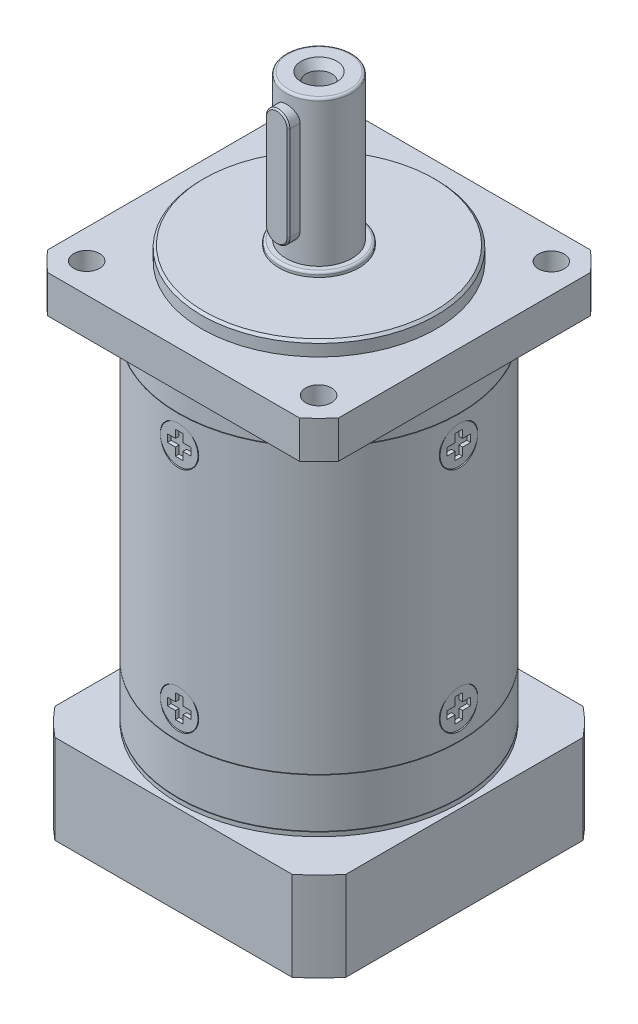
from build123d import *

# Parameters (mm, degrees)
SKETCH_1_R                = 25
EXTRUDE_1_DEPTH           = 3
SKETCH_2_R                = 30
EXTRUDE_2_DEPTH           = 13
SKETCH_3_R                = 30
EXTRUDE_3_DEPTH           = 60.4
SKETCH_4_R                = 30
EXTRUDE_4_DEPTH           = 10.4
SKETCH_5_R                = 30
EXTRUDE_5_DEPTH           = 0.9
EXTRUDE_6_DEPTH           = 19
SKETCH_7_R                = 25
CUT_EXTRUDE_1_DEPTH       = 5
SKETCH_8_R                = 17.5
CUT_EXTRUDE_2_DEPTH       = 19
SKETCH_9_R                = 16
EXTRUDE_7_DEPTH           = 17
CHAMFER_1_SIZE            = 1
SKETCH_10_R               = 7
CUT_EXTRUDE_3_DEPTH       = 32
SKETCH_11_W               = 33.69437378
SKETCH_11_H               = 1
CUT_EXTRUDE_4_DEPTH       = 17
SKETCH_12_R               = 4
CUT_EXTRUDE_5_DEPTH       = 12
PATTERN_CIRCULAR_1_COUNT  = 4
CHAMFER_3_SIZE            = 0.5
PATTERN_CIRCULAR_2_COUNT  = 4
SKETCH_15_R               = 8.5
EXTRUDE_8_DEPTH           = 1
SKETCH_16_R               = 7
EXTRUDE_9_DEPTH           = 31
FILLET_1_R                = 0.5
FILLET_2_R                = 0.5
SKETCH_19_R               = 4.1
CUT_EXTRUDE_6_DEPTH       = 31
PATTERN_CIRCULAR_5_COUNT  = 4
SKETCH_20_R               = 4
EXTRUDE_10_DEPTH          = 0.8
PATTERN_CIRCULAR_21_COUNT = 4
SKETCH_21_R               = 3.5
EXTRUDE_11_DEPTH          = 4
PATTERN_CIRCULAR_22_COUNT = 4
EXTRUDE_12_DEPTH          = 9
CHAMFER_4_SIZE            = 0.3
SKETCH_23_R               = 29.5
EXTRUDE_13_DEPTH          = 8
SKETCH_24_R               = 2.75
CUT_EXTRUDE_7_DEPTH       = 8
PATTERN_CIRCULAR_23_COUNT = 4
SKETCH_25_R               = 2.75
CUT_EXTRUDE_8_DEPTH       = 4.8
SKETCH_26_R               = 2.75
SKETCH_27_R               = 3.8


with BuildPart() as part:
    # Sketch 1 → Extrude 1 (new body)
    with BuildSketch(Plane(origin=(0, 0, 0), x_dir=(1, 0, 0), z_dir=(0, 1, 0))):
        with Locations(Location((0, 0, 0), (0, 0, 270))):
            Circle(SKETCH_1_R)
    extrude(amount=EXTRUDE_1_DEPTH)

    # Sketch 2 → Extrude 2 (add)
    with BuildSketch(Plane.XZ):
        with Locations(Location((0, 0, 0), (0, 0, 90))):
            Circle(SKETCH_2_R)
    extrude(amount=EXTRUDE_2_DEPTH)

    # Chamfer 3
    chamfer_3_edges = [part.edges().sort_by_distance(p)[0] for p in [
        (0, 3, -25),
    ]]
    chamfer(chamfer_3_edges, length=CHAMFER_3_SIZE)

    # Sketch 15 → Extrude 8 (add)
    with BuildSketch(Plane(origin=(0, 3, 0), x_dir=(1, 0, 0), z_dir=(0, 1, 0))):
        with Locations(Location((0, 0, 0), (0, 0, 270))):
            Circle(SKETCH_15_R)
    extrude(amount=EXTRUDE_8_DEPTH)

    # Sketch 16 → Extrude 9 (add)
    with BuildSketch(Plane(origin=(0, 4, 0), x_dir=(1, 0, 0), z_dir=(0, 1, 0))):
        with Locations(Location((0, 0, 0), (0, 0, 90))):
            Circle(SKETCH_16_R)
    extrude(amount=EXTRUDE_9_DEPTH)

    # Fillet 1
    fillet_1_edges = [part.edges().sort_by_distance(p)[0] for p in [
        (0, 4, -8.5),
    ]]
    fillet(fillet_1_edges, radius=FILLET_1_R)

    # Fillet 2
    fillet_2_edges = [part.edges().sort_by_distance(p)[0] for p in [
        (0, 35, 7),
    ]]
    fillet(fillet_2_edges, radius=FILLET_2_R)

    # Sketch 22 → Extrude 12 (add)
    with BuildSketch(Plane.XY):
        with BuildLine():
            Line((-2.5, 30), (-2.5, 10))
            ThreePointArc((-2.5, 10), (0, 7.5), (2.5, 10))
            Line((2.5, 10), (2.5, 30))
            ThreePointArc((2.5, 30), (0, 32.5), (-2.5, 30))
        make_face()
    extrude(amount=EXTRUDE_12_DEPTH)

    # Chamfer 4
    chamfer_4_edges = [part.edges().sort_by_distance(p)[0] for p in [
        (0, 32.5, 9),
        (-2.5, 20, 9),
        (0, 7.5, 9),
        (2.5, 20, 9),
    ]]
    chamfer(chamfer_4_edges, length=CHAMFER_4_SIZE)


with BuildPart() as body_2:
    # Sketch 3 → Extrude 3 (new body)
    with BuildSketch(Plane.XZ.offset(13.1)):
        with Locations(Location((0, 0, 0), (0, 0, 270))):
            Circle(SKETCH_3_R)
    extrude(amount=EXTRUDE_3_DEPTH)


with BuildPart() as body_3:
    # Sketch 4 → Extrude 4 (new body)
    with BuildSketch(Plane.XZ.offset(73.6)):
        with Locations(Location((0, 0, 0), (0, 0, 270))):
            Circle(SKETCH_4_R)
    extrude(amount=EXTRUDE_4_DEPTH)


with BuildPart() as body_4:
    # Sketch 5 → Extrude 5 (new body)
    with BuildSketch(Plane.XZ.offset(84.1)):
        with Locations(Location((0, 0, 0), (0, 0, 270))):
            Circle(SKETCH_5_R)
    extrude(amount=EXTRUDE_5_DEPTH)

    # Sketch 6 → Extrude 6 (add)
    with BuildSketch(Plane.XZ.offset(85)):
        with BuildLine():
            Line((-25.27844932, 31), (25.27844932, 31))
            ThreePointArc((25.27844932, 31), (28.284271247, 28.284271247), (31, 25.27844932))
            Line((31, 25.27844932), (31, -25.27844932))
            ThreePointArc((31, -25.27844932), (28.284271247, -28.284271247), (25.27844932, -31))
            Line((25.27844932, -31), (-25.27844932, -31))
            ThreePointArc((-25.27844932, -31), (-28.284271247, -28.284271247), (-31, -25.27844932))
            Line((-31, -25.27844932), (-31, 25.27844932))
            ThreePointArc((-31, 25.27844932), (-28.284271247, 28.284271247), (-25.27844932, 31))
        make_face()
    extrude(amount=EXTRUDE_6_DEPTH)

    # Sketch 7 → Cut-Extrude 1 (cut)
    with BuildSketch(Plane.XZ.offset(104)):
        with Locations(Location((0, 0, 0), (0, 0, 270))):
            Circle(SKETCH_7_R)
    extrude(amount=-CUT_EXTRUDE_1_DEPTH, mode=Mode.SUBTRACT)


with BuildPart() as cut_extrude_2_tool:
    # Sketch 8 → Cut-Extrude 2 (new body)
    with BuildSketch(Plane.XZ.offset(99)):
        with Locations(Location((0, 0, 0), (0, 0, 270))):
            Circle(SKETCH_8_R)
    extrude(amount=-CUT_EXTRUDE_2_DEPTH)


with BuildPart() as body_3_1:
    add(body_3.part)

    # Cut-Extrude 2: cut by cut_extrude_2_tool
    add(cut_extrude_2_tool.part, mode=Mode.SUBTRACT)

    # Sketch 9 → Extrude 7 (add)
    with BuildSketch(Plane.XZ.offset(97)):
        with Locations(Location((0, 0, 0), (0, 0, 270))):
            Circle(SKETCH_9_R)
    extrude(amount=-EXTRUDE_7_DEPTH)

    # Chamfer 1
    chamfer_1_edges = [body_3_1.edges().sort_by_distance(p)[0] for p in [
        (0, -97, 16),
    ]]
    chamfer(chamfer_1_edges, length=CHAMFER_1_SIZE)


with BuildPart() as body_4_1:
    add(body_4.part)

    # Cut-Extrude 2: cut by cut_extrude_2_tool
    add(cut_extrude_2_tool.part, mode=Mode.SUBTRACT)

    # Sketch 12 → Cut-Extrude 5 (cut)
    with BuildSketch(Plane.XZ.offset(104)):
        with Locations(Location((-12.75, 22.083647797, 0), (0, 0, 270))):
            Circle(SKETCH_12_R)
    cut_extrude_5 = extrude(amount=-CUT_EXTRUDE_5_DEPTH, mode=Mode.SUBTRACT)

    # Pattern Circular 1: Cut-Extrude 5 ×4 about axis
    pattern_circular_1_axis = Axis((0, 0, 0), (0, 1, 0))
    for i in range(1, PATTERN_CIRCULAR_1_COUNT):
        add(cut_extrude_5.rotate(pattern_circular_1_axis, i * 360 / PATTERN_CIRCULAR_1_COUNT), mode=Mode.SUBTRACT)

    # Sketch 14 → Hole Wizard M4 _1 (revolve, cut)
    with BuildSketch(Plane(origin=(-24.748737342, -104, -24.748737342), x_dir=(0, 0, -1), z_dir=(1, 0, 0))):
        Polygon((0, 0), (0, 14.491420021), (1.65, 13.5), (1.65, 0), align=None)
    hole_wizard_m4_1 = revolve(axis=Axis((-24.748737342, -110.35, -24.748737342), (0, 1, 0)), mode=Mode.SUBTRACT)

    # Pattern Circular 2: Hole Wizard M4 _1 ×4 about axis
    pattern_circular_2_axis = Axis((0, 0, 0), (0, 1, 0))
    for i in range(1, PATTERN_CIRCULAR_2_COUNT):
        add(hole_wizard_m4_1.rotate(pattern_circular_2_axis, i * 360 / PATTERN_CIRCULAR_2_COUNT), mode=Mode.SUBTRACT)

    # Sketch 21 → Extrude 11 (add)
    with BuildSketch(Plane.XZ.offset(92)):
        with Locations(Location((-12.75, 22.083647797, 0), (0, 0, 270))):
            Circle(SKETCH_21_R)
        Polygon((-11.866340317, 23.573327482), (-13.598270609, 23.593759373), (-14.481930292, 22.104079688), (-13.633659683, 20.593968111), (-11.901729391, 20.57353622), (-11.018069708, 22.063215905), align=None, mode=Mode.SUBTRACT)
    extrude_11 = extrude(amount=EXTRUDE_11_DEPTH)

    # Pattern Circular 22: Extrude 11 ×4 about axis
    pattern_circular_22_axis = Axis((0, 0, 0), (0, 1, 0))
    for i in range(1, PATTERN_CIRCULAR_22_COUNT):
        add(extrude_11.rotate(pattern_circular_22_axis, i * 360 / PATTERN_CIRCULAR_22_COUNT))


with BuildPart() as cut_extrude_3_tool:
    # Sketch 10 → Cut-Extrude 3 (new body)
    with BuildSketch(Plane.XZ.offset(104)):
        with Locations(Location((0, 0, 0), (0, 0, 270))):
            Circle(SKETCH_10_R)
    extrude(amount=-CUT_EXTRUDE_3_DEPTH)


with BuildPart() as body_2_1:
    add(body_2.part)

    # Cut-Extrude 3: cut by cut_extrude_3_tool
    add(cut_extrude_3_tool.part, mode=Mode.SUBTRACT)

    # Sketch 19 → Cut-Extrude 6 (cut)
    with BuildSketch(Plane.XY.offset(29)):
        with Locations(Location((0, -19, 0), (0, 0, 270))):
            Circle(SKETCH_19_R)
        with Locations(Location((0, -67.6, 0), (0, 0, 270))):
            Circle(SKETCH_19_R)
    cut_extrude_6 = extrude(amount=CUT_EXTRUDE_6_DEPTH, mode=Mode.SUBTRACT)

    # Pattern Circular 5: Cut-Extrude 6 ×4 about axis
    pattern_circular_5_axis = Axis((0, 0, 0), (0, 1, 0))
    for i in range(1, PATTERN_CIRCULAR_5_COUNT):
        add(cut_extrude_6.rotate(pattern_circular_5_axis, i * 360 / PATTERN_CIRCULAR_5_COUNT), mode=Mode.SUBTRACT)

    # Sketch 20 → Extrude 10 (add)
    # profile 1 of 2: a face of its own
    with BuildSketch(Plane.XY.offset(29)):
        with Locations((0, -19)):
            Circle(SKETCH_20_R)
        Polygon((0.8, -19.8), (0.8, -21.5), (-0.8, -21.5), (-0.8, -19.8), (-2.5, -19.8), (-2.5, -18.2), (-0.8, -18.2), (-0.8, -16.5), (0.8, -16.5), (0.8, -18.2), (2.5, -18.2), (2.5, -19.8), align=None, mode=Mode.SUBTRACT)
    # profile 2 of 2: a face of its own
    with BuildSketch(Plane.XY.offset(29)):
        with Locations((0, -67.6)):
            Circle(SKETCH_20_R)
        Polygon((0.8, -68.4), (0.8, -70.1), (-0.8, -70.1), (-0.8, -68.4), (-2.5, -68.4), (-2.5, -66.8), (-0.8, -66.8), (-0.8, -65.1), (0.8, -65.1), (0.8, -66.8), (2.5, -66.8), (2.5, -68.4), align=None, mode=Mode.SUBTRACT)
    extrude_10 = extrude(amount=EXTRUDE_10_DEPTH)

    # Pattern Circular 21: Extrude 10 ×4 about axis
    pattern_circular_21_axis = Axis((0, 0, 0), (0, 1, 0))
    for i in range(1, PATTERN_CIRCULAR_21_COUNT):
        add(extrude_10.rotate(pattern_circular_21_axis, i * 360 / PATTERN_CIRCULAR_21_COUNT))


with BuildPart() as body_3_2:
    add(body_3_1.part)

    # Cut-Extrude 3: cut by cut_extrude_3_tool
    add(cut_extrude_3_tool.part, mode=Mode.SUBTRACT)

    # Sketch 11 → Cut-Extrude 4 (cut)
    with BuildSketch(Plane.XZ.offset(97)):
        with Locations((0.125567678, 0)):
            Rectangle(SKETCH_11_W, SKETCH_11_H)
    extrude(amount=-CUT_EXTRUDE_4_DEPTH, mode=Mode.SUBTRACT)


with BuildPart() as body_5:
    # Sketch 23 → Extrude 13 (new body)
    with BuildSketch(Plane(origin=(0, 0, 0), x_dir=(1, 0, 0), z_dir=(0, 1, 0))):
        with BuildLine():
            Line((-26.83281573, 31), (26.83281573, 31))
            ThreePointArc((26.83281573, 31), (28.991378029, 28.991378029), (31, 26.83281573))
            Line((31, 26.83281573), (31, -26.83281573))
            ThreePointArc((31, -26.83281573), (28.991378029, -28.991378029), (26.83281573, -31))
            Line((26.83281573, -31), (-26.83281573, -31))
            ThreePointArc((-26.83281573, -31), (-28.991378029, -28.991378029), (-31, -26.83281573))
            Line((-31, -26.83281573), (-31, 26.83281573))
            ThreePointArc((-31, 26.83281573), (-28.991378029, 28.991378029), (-26.83281573, 31))
        make_face()
        with Locations(Location((0, 0, 0), (0, 0, 270))):
            Circle(SKETCH_23_R, mode=Mode.SUBTRACT)
    extrude(amount=-EXTRUDE_13_DEPTH)

    # Combine 1: union part
    add(part.part)

    # Sketch 24 → Cut-Extrude 7 (cut)
    with BuildSketch(Plane(origin=(0, 0, 0), x_dir=(1, 0, 0), z_dir=(0, 1, 0))):
        with Locations(Location((-24.704605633, 24.792790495, 0), (0, 0, 270))):
            Circle(SKETCH_24_R)
    cut_extrude_7 = extrude(amount=-CUT_EXTRUDE_7_DEPTH, mode=Mode.SUBTRACT)

    # Pattern Circular 23: Cut-Extrude 7 ×4 about axis
    pattern_circular_23_axis = Axis((0, 0, 0), (0, 1, 0))
    for i in range(1, PATTERN_CIRCULAR_23_COUNT):
        add(cut_extrude_7.rotate(pattern_circular_23_axis, i * 360 / PATTERN_CIRCULAR_23_COUNT), mode=Mode.SUBTRACT)

    # Sketch 25 → Cut-Extrude 8 (cut)
    with BuildSketch(Plane(origin=(0, 35, 0), x_dir=(1, 0, 0), z_dir=(0, 1, 0))):
        with Locations(Location((0, 0, 0), (0, 0, 270))):
            Circle(SKETCH_25_R)
    extrude(amount=-CUT_EXTRUDE_8_DEPTH, mode=Mode.SUBTRACT)

    # Sketch 26 → Loft 1 section 0
    with BuildSketch(Plane(origin=(0, 33.2, 0), x_dir=(-1, 0, 0), z_dir=(0, 1, 0))):
        Circle(SKETCH_26_R)
    # Sketch 27 → Loft 1 section 1
    with BuildSketch(Plane(origin=(0, 35, 0), x_dir=(1, 0, 0), z_dir=(0, 1, 0))):
        Circle(SKETCH_27_R)
    loft(mode=Mode.SUBTRACT)

    # Sketch 28 → Hole Wizard M5 _1 (revolve, cut)
    with BuildSketch(Plane(origin=(0, 30.2, 0), x_dir=(0, 0, 1), z_dir=(1, 0, 0))):
        Polygon((0, 0), (0, 12.9618073), (2.1, 11.7), (2.1, 0), align=None)
    revolve(axis=Axis((0, 36.55, 0), (0, -1, 0)), mode=Mode.SUBTRACT)


solid = Compound([body_4_1.part, body_2_1.part, body_3_2.part, body_5.part])
